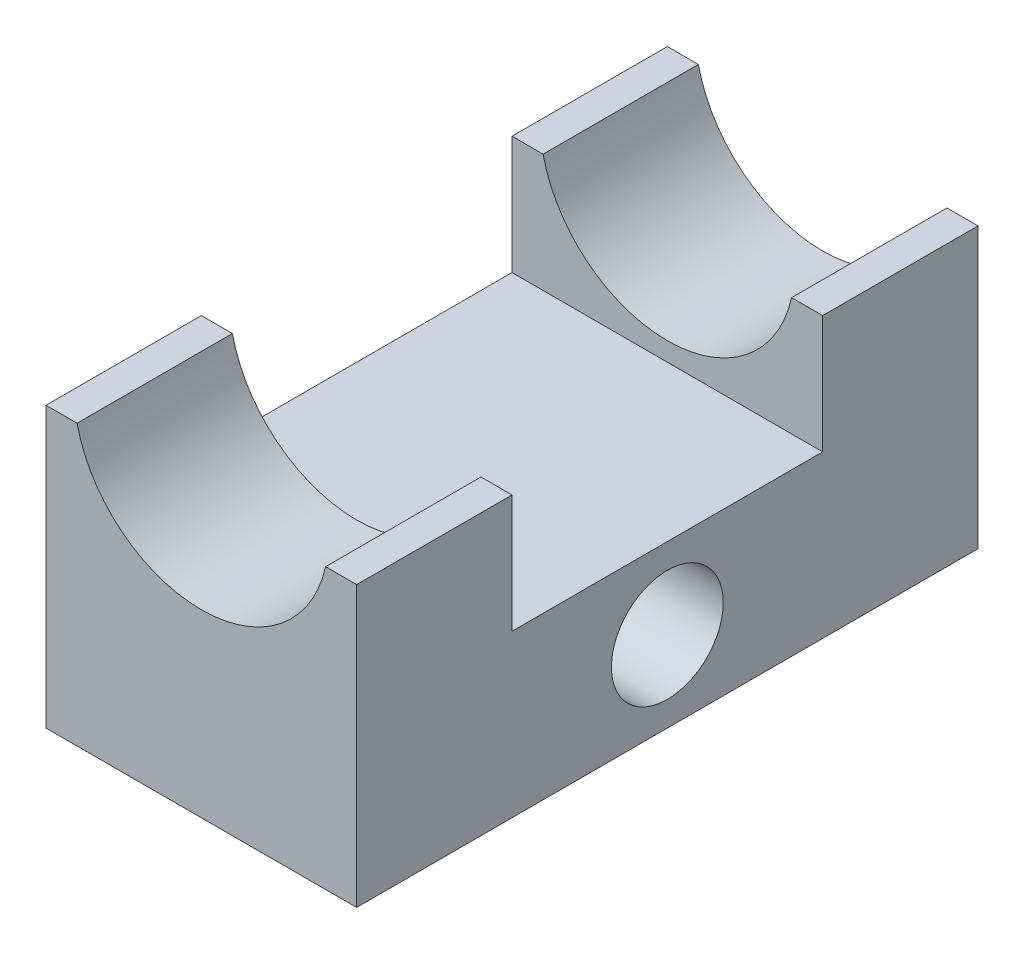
from build123d import *

# Parameters (mm, degrees)
BOSS_EXTRU_1_DEPTH      = 100
ESQUISSE2_W             = 50
ESQUISSE2_H             = 19
ENL_V_MAT_EXTRU_1_DEPTH = 100
ESQUISSE3_R             = 9
ENL_V_MAT_EXTRU_2_DEPTH = 100


with BuildPart() as part:
    # Esquisse1 → Boss.-Extru.1 (new body)
    with BuildSketch(Plane.XY):
        with BuildLine():
            Line((999.918500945, 343.347562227), (994.918500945, 343.347562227))
            Line((994.918500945, 343.347562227), (994.918500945, 298.347562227))
            Line((994.918500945, 298.347562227), (1044.918500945, 298.347562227))
            Line((1044.918500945, 298.347562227), (1044.918500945, 343.347562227))
            Line((1044.918500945, 343.347562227), (1039.918500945, 343.347562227))
            ThreePointArc((1039.918500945, 343.347562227), (1019.918500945, 327.347562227), (999.918500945, 343.347562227))
        make_face()
    extrude(amount=BOSS_EXTRU_1_DEPTH)

    # Esquisse2 → Enl_v. mat.-Extru.1 (cut)
    with BuildSketch(Plane(origin=(1044.918500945, 0, 0), x_dir=(0, 0, -1), z_dir=(1, 0, 0))):
        with Locations((-50, 333.847562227)):
            Rectangle(ESQUISSE2_W, ESQUISSE2_H)
    extrude(amount=-ENL_V_MAT_EXTRU_1_DEPTH, mode=Mode.SUBTRACT)

    # Esquisse3 → Enl_v. mat.-Extru.2 (cut)
    with BuildSketch(Plane(origin=(1044.918500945, 0, 0), x_dir=(0, 0, -1), z_dir=(1, 0, 0))):
        with Locations((-50, 311.347562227)):
            Circle(ESQUISSE3_R)
    extrude(amount=-ENL_V_MAT_EXTRU_2_DEPTH, mode=Mode.SUBTRACT)


solid = part.part
